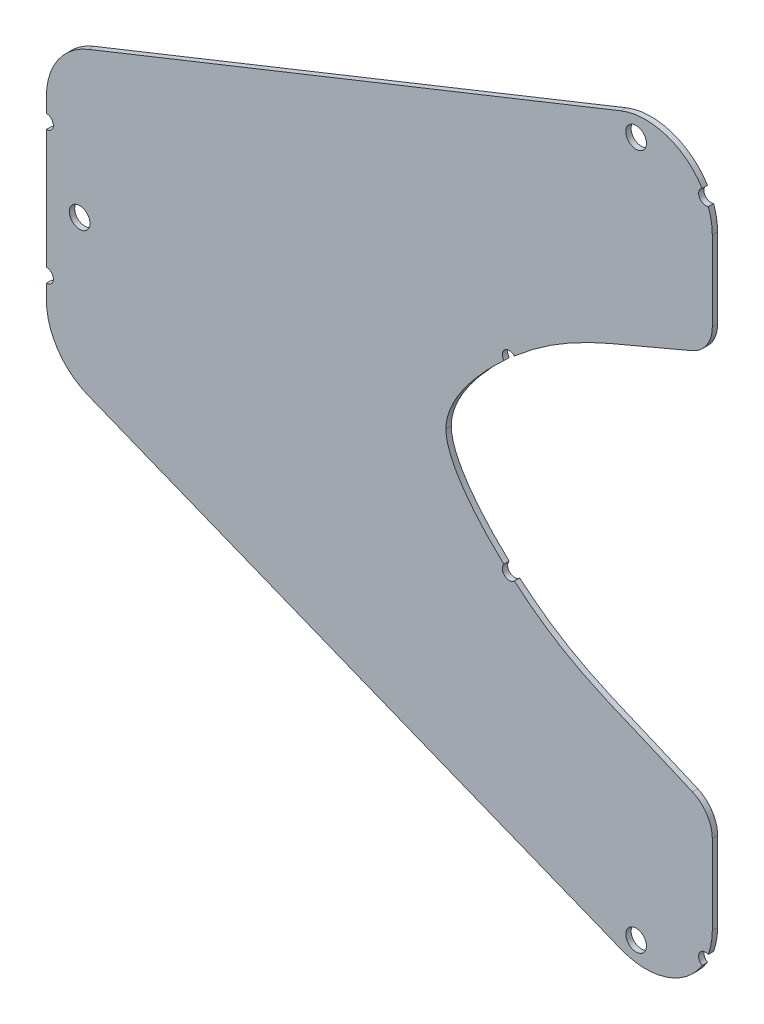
from build123d import *

# Parameters (mm, degrees)
ESQUISSE1_R      = 1.55
EXTRUSION1_DEPTH = 0.8


with BuildPart() as part:
    # Esquisse1 → Extrusion1 (new body)
    with BuildSketch(Plane.XY):
        with BuildLine():
            Line((0, 13.229670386), (0, 11.05))
            ThreePointArc((0, 11.05), (1.05, 10), (0, 8.95))
            Line((0, 8.95), (0, -8.95))
            ThreePointArc((0, -8.95), (1.05, -10), (0, -11.05))
            Line((0, -11.05), (0, -13.229670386))
            ThreePointArc((0, -13.229670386), (1.719327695, -18.835958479), (6.286093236, -22.514437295))
            Line((6.286093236, -22.514437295), (86.286093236, -54.514437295))
            ThreePointArc((86.286093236, -54.514437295), (93.113139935, -54.732741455), (98.487713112, -50.517271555))
            ThreePointArc((98.487713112, -50.517271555), (98.050844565, -49.139453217), (99.403827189, -48.630851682))
            ThreePointArc((99.403827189, -48.630851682), (99.849829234, -46.956188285), (100, -45.229670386))
            Line((100, -45.229670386), (100, -33.256005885))
            ThreePointArc((100, -33.256005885), (99.191078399, -30.529311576), (97.026055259, -28.684890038))
            add(Edge.make_bspline(
                [(97.026055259, -28.684890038), (85.708968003, -23.668818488), (79.068022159, -21.975200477), (70.663659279, -14.965115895), (70.275371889, -14.632479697)],
                knots=[0.049678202, 0.049678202, 0.049678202, 0.049678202, 0.617749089, 0.645173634, 0.645173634, 0.645173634, 0.645173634], degree=3))
            ThreePointArc((70.275371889, -14.632479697), (68.822127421, -14.688991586), (68.706420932, -13.239258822))
            add(Edge.make_bspline(
                [(68.706420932, -13.239258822), (64.219328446, -9.108559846), (60.01836992, -3.928466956), (60, 0)],
                knots=[0.682096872, 0.682096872, 0.682096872, 0.682096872, 1, 1, 1, 1], degree=3))
            add(Edge.make_bspline(
                [(68.706420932, 13.239258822), (64.219328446, 9.108559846), (60.01836992, 3.928466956), (60, 0)],
                knots=[0.682096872, 0.682096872, 0.682096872, 0.682096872, 1, 1, 1, 1], degree=3))
            ThreePointArc((68.706420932, 13.239258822), (68.822127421, 14.688991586), (70.275371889, 14.632479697))
            add(Edge.make_bspline(
                [(97.026055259, 28.684890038), (85.708968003, 23.668818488), (79.068022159, 21.975200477), (70.663659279, 14.965115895), (70.275371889, 14.632479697)],
                knots=[0.049678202, 0.049678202, 0.049678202, 0.049678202, 0.617749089, 0.645173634, 0.645173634, 0.645173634, 0.645173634], degree=3))
            ThreePointArc((97.026055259, 28.684890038), (99.191078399, 30.529311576), (100, 33.256005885))
            Line((100, 33.256005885), (100, 45.229670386))
            ThreePointArc((100, 45.229670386), (99.849829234, 46.956188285), (99.403827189, 48.630851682))
            ThreePointArc((99.403827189, 48.630851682), (98.050844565, 49.139453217), (98.487713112, 50.517271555))
            ThreePointArc((98.487713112, 50.517271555), (93.113139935, 54.732741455), (86.286093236, 54.514437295))
            Line((86.286093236, 54.514437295), (6.286093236, 22.514437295))
            ThreePointArc((6.286093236, 22.514437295), (1.719327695, 18.835958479), (0, 13.229670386))
        make_face()
        with Locations((5, 0)):
            Circle(ESQUISSE1_R, mode=Mode.SUBTRACT)
        with Locations((88.559040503, 52.192517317)):
            Circle(ESQUISSE1_R, mode=Mode.SUBTRACT)
        with Locations(Location((88.559040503, -52.192517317, 0), (0, 0, 180))):
            Circle(ESQUISSE1_R, mode=Mode.SUBTRACT)
    extrude(amount=EXTRUSION1_DEPTH)


solid = part.part
